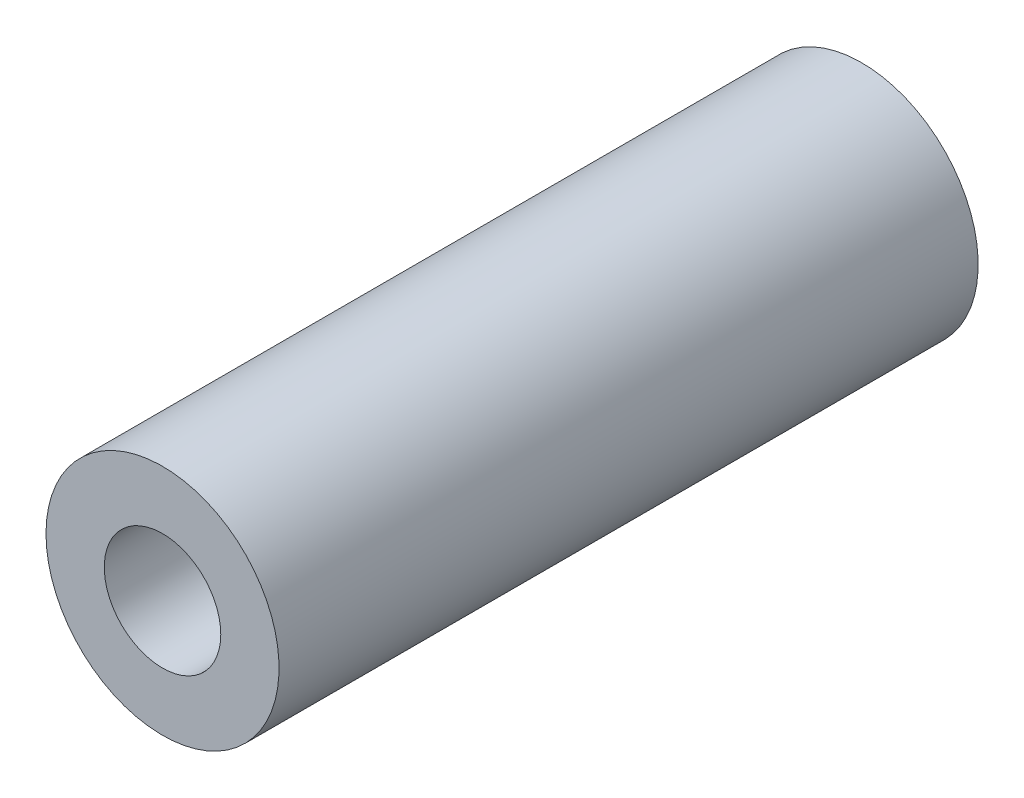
ISO-10303-21;
HEADER;
FILE_DESCRIPTION(('STEP AP214'),'2;1');
FILE_NAME('part.step','',(''),(''),'','','');
FILE_SCHEMA(('AUTOMOTIVE_DESIGN { 1 0 10303 214 1 1 1 1 }'));
ENDSEC;
DATA;
#1=APPLICATION_CONTEXT('core data for automotive mechanical design processes');
#2=APPLICATION_PROTOCOL_DEFINITION('international standard','automotive_design',2000,#1);
#3=PRODUCT_CONTEXT('',#1,'mechanical');
#4=PRODUCT('Part','Part','',(#3));
#5=PRODUCT_RELATED_PRODUCT_CATEGORY('part','',(#4));
#6=PRODUCT_DEFINITION_FORMATION('','',#4);
#7=PRODUCT_DEFINITION_CONTEXT('part definition',#1,'design');
#8=PRODUCT_DEFINITION('design','',#6,#7);
#9=PRODUCT_DEFINITION_SHAPE('','',#8);
#10=(LENGTH_UNIT() NAMED_UNIT(*) SI_UNIT(.MILLI.,.METRE.));
#11=(NAMED_UNIT(*) PLANE_ANGLE_UNIT() SI_UNIT($,.RADIAN.));
#12=(NAMED_UNIT(*) SI_UNIT($,.STERADIAN.) SOLID_ANGLE_UNIT());
#13=UNCERTAINTY_MEASURE_WITH_UNIT(LENGTH_MEASURE(1.E-05),#10,'distance_accuracy_value','');
#14=(GEOMETRIC_REPRESENTATION_CONTEXT(3) GLOBAL_UNCERTAINTY_ASSIGNED_CONTEXT((#13)) GLOBAL_UNIT_ASSIGNED_CONTEXT((#10,
#11,#12)) REPRESENTATION_CONTEXT('',''));
#15=CARTESIAN_POINT('',(0.,0.,0.));
#16=DIRECTION('',(0.,0.,1.));
#17=DIRECTION('',(1.,0.,0.));
#18=AXIS2_PLACEMENT_3D('',#15,#16,#17);
#19=CARTESIAN_POINT('',(0.,0.,19.05));
#20=DIRECTION('',(0.,0.,-1.));
#21=DIRECTION('',(-1.,0.,0.));
#22=AXIS2_PLACEMENT_3D('',#19,#20,#21);
#23=CYLINDRICAL_SURFACE('',#22,3.175);
#24=CARTESIAN_POINT('',(0.,0.,19.05));
#25=DIRECTION('',(0.,0.,1.));
#26=DIRECTION('',(1.,0.,0.));
#27=AXIS2_PLACEMENT_3D('',#24,#25,#26);
#28=CIRCLE('',#27,3.175);
#29=CARTESIAN_POINT('',(-3.175,0.,19.05));
#30=VERTEX_POINT('',#29);
#31=EDGE_CURVE('E10',#30,#30,#28,.T.);
#32=CARTESIAN_POINT('',(0.,0.,0.));
#33=DIRECTION('',(0.,0.,1.));
#34=DIRECTION('',(1.,0.,0.));
#35=AXIS2_PLACEMENT_3D('',#32,#33,#34);
#36=CIRCLE('',#35,3.175);
#37=CARTESIAN_POINT('',(-3.175,0.,0.));
#38=VERTEX_POINT('',#37);
#39=EDGE_CURVE('E38',#38,#38,#36,.T.);
#40=CARTESIAN_POINT('',(-3.175,0.,19.05));
#41=CARTESIAN_POINT('',(-3.175,0.,18.8515625));
#42=CARTESIAN_POINT('',(-3.175,0.,18.653125));
#43=CARTESIAN_POINT('',(-3.175,0.,18.25625));
#44=CARTESIAN_POINT('',(-3.175,0.,18.0578125));
#45=CARTESIAN_POINT('',(-3.175,0.,17.6609375));
#46=CARTESIAN_POINT('',(-3.175,0.,17.4625));
#47=CARTESIAN_POINT('',(-3.175,0.,17.065625));
#48=CARTESIAN_POINT('',(-3.175,0.,16.8671875));
#49=CARTESIAN_POINT('',(-3.175,0.,16.4703125));
#50=CARTESIAN_POINT('',(-3.175,0.,16.271875));
#51=CARTESIAN_POINT('',(-3.175,0.,15.875));
#52=CARTESIAN_POINT('',(-3.175,0.,15.6765625));
#53=CARTESIAN_POINT('',(-3.175,0.,15.2796875));
#54=CARTESIAN_POINT('',(-3.175,0.,15.08125));
#55=CARTESIAN_POINT('',(-3.175,0.,14.684375));
#56=CARTESIAN_POINT('',(-3.175,0.,14.4859375));
#57=CARTESIAN_POINT('',(-3.175,0.,14.0890625));
#58=CARTESIAN_POINT('',(-3.175,0.,13.890625));
#59=CARTESIAN_POINT('',(-3.175,0.,13.49375));
#60=CARTESIAN_POINT('',(-3.175,0.,13.2953125));
#61=CARTESIAN_POINT('',(-3.175,0.,12.8984375));
#62=CARTESIAN_POINT('',(-3.175,0.,12.7));
#63=CARTESIAN_POINT('',(-3.175,0.,12.303125));
#64=CARTESIAN_POINT('',(-3.175,0.,12.1046875));
#65=CARTESIAN_POINT('',(-3.175,0.,11.7078125));
#66=CARTESIAN_POINT('',(-3.175,0.,11.509375));
#67=CARTESIAN_POINT('',(-3.175,0.,11.1125));
#68=CARTESIAN_POINT('',(-3.175,0.,10.9140625));
#69=CARTESIAN_POINT('',(-3.175,0.,10.5171875));
#70=CARTESIAN_POINT('',(-3.175,0.,10.31875));
#71=CARTESIAN_POINT('',(-3.175,0.,9.921875));
#72=CARTESIAN_POINT('',(-3.175,0.,9.7234375));
#73=CARTESIAN_POINT('',(-3.175,0.,9.3265625));
#74=CARTESIAN_POINT('',(-3.175,0.,9.128125));
#75=CARTESIAN_POINT('',(-3.175,0.,8.73125));
#76=CARTESIAN_POINT('',(-3.175,0.,8.5328125));
#77=CARTESIAN_POINT('',(-3.175,0.,8.1359375));
#78=CARTESIAN_POINT('',(-3.175,0.,7.9375));
#79=CARTESIAN_POINT('',(-3.175,0.,7.540625));
#80=CARTESIAN_POINT('',(-3.175,0.,7.3421875));
#81=CARTESIAN_POINT('',(-3.175,0.,6.9453125));
#82=CARTESIAN_POINT('',(-3.175,0.,6.746875));
#83=CARTESIAN_POINT('',(-3.175,0.,6.35));
#84=CARTESIAN_POINT('',(-3.175,0.,6.1515625));
#85=CARTESIAN_POINT('',(-3.175,0.,5.7546875));
#86=CARTESIAN_POINT('',(-3.175,0.,5.55625));
#87=CARTESIAN_POINT('',(-3.175,0.,5.159375));
#88=CARTESIAN_POINT('',(-3.175,0.,4.9609375));
#89=CARTESIAN_POINT('',(-3.175,0.,4.5640625));
#90=CARTESIAN_POINT('',(-3.175,0.,4.365625));
#91=CARTESIAN_POINT('',(-3.175,0.,3.96875));
#92=CARTESIAN_POINT('',(-3.175,0.,3.7703125));
#93=CARTESIAN_POINT('',(-3.175,0.,3.3734375));
#94=CARTESIAN_POINT('',(-3.175,0.,3.175));
#95=CARTESIAN_POINT('',(-3.175,0.,2.778125));
#96=CARTESIAN_POINT('',(-3.175,0.,2.5796875));
#97=CARTESIAN_POINT('',(-3.175,0.,2.1828125));
#98=CARTESIAN_POINT('',(-3.175,0.,1.984375));
#99=CARTESIAN_POINT('',(-3.175,0.,1.5875));
#100=CARTESIAN_POINT('',(-3.175,0.,1.3890625));
#101=CARTESIAN_POINT('',(-3.175,0.,0.992187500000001));
#102=CARTESIAN_POINT('',(-3.175,0.,0.793750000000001));
#103=CARTESIAN_POINT('',(-3.175,0.,0.396875));
#104=CARTESIAN_POINT('',(-3.175,0.,0.1984375));
#105=CARTESIAN_POINT('',(-3.175,0.,0.));
#106=B_SPLINE_CURVE_WITH_KNOTS('',3,(#40,#41,#42,#43,#44,#45,#46,#47,#48,#49,#50,#51,#52,#53,
#54,#55,#56,#57,#58,#59,#60,#61,#62,#63,#64,#65,#66,#67,#68,#69,#70,#71,#72,#73,#74,#75,#76,#77,
#78,#79,#80,#81,#82,#83,#84,#85,#86,#87,#88,#89,#90,#91,#92,#93,#94,#95,#96,#97,#98,#99,#100,
#101,#102,#103,#104,#105),.UNSPECIFIED.,.F.,.F.,(4,2,2,2,2,2,2,2,2,2,2,2,2,2,2,2,2,2,2,2,2,2,2,
2,2,2,2,2,2,2,2,2,4),(0.,0.595312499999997,1.190625,1.7859375,2.38125,2.9765625,3.571875,
4.1671875,4.7625,5.3578125,5.953125,6.5484375,7.14375,7.7390625,8.334375,8.9296875,9.525,
10.1203125,10.715625,11.3109375,11.90625,12.5015625,13.096875,13.6921875,14.2875,14.8828125,
15.478125,16.0734375,16.66875,17.2640625,17.859375,18.4546875,19.05),.UNSPECIFIED.);
#107=EDGE_CURVE('BSEAM31',#30,#38,#106,.T.);
#108=ORIENTED_EDGE('',*,*,#31,.F.);
#109=ORIENTED_EDGE('',*,*,#39,.T.);
#110=ORIENTED_EDGE('',*,*,#107,.T.);
#111=ORIENTED_EDGE('',*,*,#107,.F.);
#112=EDGE_LOOP('',(#108,#110,#109,#111));
#113=FACE_BOUND('',#112,.T.);
#114=ADVANCED_FACE('F31',(#113),#23,.T.);
#115=CARTESIAN_POINT('',(0.,0.,19.05));
#116=DIRECTION('',(0.,0.,1.));
#117=DIRECTION('',(1.,0.,0.));
#118=AXIS2_PLACEMENT_3D('',#115,#116,#117);
#119=PLANE('',#118);
#120=CARTESIAN_POINT('',(0.,0.,19.05));
#121=DIRECTION('',(0.,0.,1.));
#122=DIRECTION('',(1.,0.,0.));
#123=AXIS2_PLACEMENT_3D('',#120,#121,#122);
#124=CIRCLE('',#123,1.5875);
#125=CARTESIAN_POINT('',(1.5875,0.,19.05));
#126=VERTEX_POINT('',#125);
#127=EDGE_CURVE('E44',#126,#126,#124,.T.);
#128=ORIENTED_EDGE('',*,*,#127,.F.);
#129=EDGE_LOOP('',(#128));
#130=FACE_BOUND('',#129,.T.);
#131=ORIENTED_EDGE('',*,*,#31,.T.);
#132=EDGE_LOOP('',(#131));
#133=FACE_BOUND('',#132,.T.);
#134=ADVANCED_FACE('F60',(#130,#133),#119,.T.);
#135=CARTESIAN_POINT('',(0.,0.,0.));
#136=DIRECTION('',(0.,0.,1.));
#137=DIRECTION('',(1.,0.,0.));
#138=AXIS2_PLACEMENT_3D('',#135,#136,#137);
#139=PLANE('',#138);
#140=CARTESIAN_POINT('',(0.,0.,0.));
#141=DIRECTION('',(0.,0.,1.));
#142=DIRECTION('',(1.,0.,0.));
#143=AXIS2_PLACEMENT_3D('',#140,#141,#142);
#144=CIRCLE('',#143,1.5875);
#145=CARTESIAN_POINT('',(1.5875,0.,0.));
#146=VERTEX_POINT('',#145);
#147=EDGE_CURVE('E34',#146,#146,#144,.T.);
#148=ORIENTED_EDGE('',*,*,#147,.T.);
#149=EDGE_LOOP('',(#148));
#150=FACE_BOUND('',#149,.T.);
#151=ORIENTED_EDGE('',*,*,#39,.F.);
#152=EDGE_LOOP('',(#151));
#153=FACE_BOUND('',#152,.T.);
#154=ADVANCED_FACE('F51',(#150,#153),#139,.F.);
#155=CARTESIAN_POINT('',(0.,0.,-19.05));
#156=DIRECTION('',(0.,0.,1.));
#157=DIRECTION('',(1.,0.,0.));
#158=AXIS2_PLACEMENT_3D('',#155,#156,#157);
#159=CYLINDRICAL_SURFACE('',#158,1.5875);
#160=CARTESIAN_POINT('',(1.5875,0.,19.05));
#161=CARTESIAN_POINT('',(1.5875,0.,18.8515625));
#162=CARTESIAN_POINT('',(1.5875,0.,18.653125));
#163=CARTESIAN_POINT('',(1.5875,0.,18.25625));
#164=CARTESIAN_POINT('',(1.5875,0.,18.0578125));
#165=CARTESIAN_POINT('',(1.5875,0.,17.6609375));
#166=CARTESIAN_POINT('',(1.5875,0.,17.4625));
#167=CARTESIAN_POINT('',(1.5875,0.,17.065625));
#168=CARTESIAN_POINT('',(1.5875,0.,16.8671875));
#169=CARTESIAN_POINT('',(1.5875,0.,16.4703125));
#170=CARTESIAN_POINT('',(1.5875,0.,16.271875));
#171=CARTESIAN_POINT('',(1.5875,0.,15.875));
#172=CARTESIAN_POINT('',(1.5875,0.,15.6765625));
#173=CARTESIAN_POINT('',(1.5875,0.,15.2796875));
#174=CARTESIAN_POINT('',(1.5875,0.,15.08125));
#175=CARTESIAN_POINT('',(1.5875,0.,14.684375));
#176=CARTESIAN_POINT('',(1.5875,0.,14.4859375));
#177=CARTESIAN_POINT('',(1.5875,0.,14.0890625));
#178=CARTESIAN_POINT('',(1.5875,0.,13.890625));
#179=CARTESIAN_POINT('',(1.5875,0.,13.49375));
#180=CARTESIAN_POINT('',(1.5875,0.,13.2953125));
#181=CARTESIAN_POINT('',(1.5875,0.,12.8984375));
#182=CARTESIAN_POINT('',(1.5875,0.,12.7));
#183=CARTESIAN_POINT('',(1.5875,0.,12.303125));
#184=CARTESIAN_POINT('',(1.5875,0.,12.1046875));
#185=CARTESIAN_POINT('',(1.5875,0.,11.7078125));
#186=CARTESIAN_POINT('',(1.5875,0.,11.509375));
#187=CARTESIAN_POINT('',(1.5875,0.,11.1125));
#188=CARTESIAN_POINT('',(1.5875,0.,10.9140625));
#189=CARTESIAN_POINT('',(1.5875,0.,10.5171875));
#190=CARTESIAN_POINT('',(1.5875,0.,10.31875));
#191=CARTESIAN_POINT('',(1.5875,0.,9.921875));
#192=CARTESIAN_POINT('',(1.5875,0.,9.7234375));
#193=CARTESIAN_POINT('',(1.5875,0.,9.3265625));
#194=CARTESIAN_POINT('',(1.5875,0.,9.128125));
#195=CARTESIAN_POINT('',(1.5875,0.,8.73125));
#196=CARTESIAN_POINT('',(1.5875,0.,8.5328125));
#197=CARTESIAN_POINT('',(1.5875,0.,8.1359375));
#198=CARTESIAN_POINT('',(1.5875,0.,7.9375));
#199=CARTESIAN_POINT('',(1.5875,0.,7.540625));
#200=CARTESIAN_POINT('',(1.5875,0.,7.3421875));
#201=CARTESIAN_POINT('',(1.5875,0.,6.9453125));
#202=CARTESIAN_POINT('',(1.5875,0.,6.746875));
#203=CARTESIAN_POINT('',(1.5875,0.,6.35));
#204=CARTESIAN_POINT('',(1.5875,0.,6.1515625));
#205=CARTESIAN_POINT('',(1.5875,0.,5.7546875));
#206=CARTESIAN_POINT('',(1.5875,0.,5.55625));
#207=CARTESIAN_POINT('',(1.5875,0.,5.159375));
#208=CARTESIAN_POINT('',(1.5875,0.,4.9609375));
#209=CARTESIAN_POINT('',(1.5875,0.,4.5640625));
#210=CARTESIAN_POINT('',(1.5875,0.,4.365625));
#211=CARTESIAN_POINT('',(1.5875,0.,3.96875));
#212=CARTESIAN_POINT('',(1.5875,0.,3.7703125));
#213=CARTESIAN_POINT('',(1.5875,0.,3.3734375));
#214=CARTESIAN_POINT('',(1.5875,0.,3.175));
#215=CARTESIAN_POINT('',(1.5875,0.,2.778125));
#216=CARTESIAN_POINT('',(1.5875,0.,2.5796875));
#217=CARTESIAN_POINT('',(1.5875,0.,2.1828125));
#218=CARTESIAN_POINT('',(1.5875,0.,1.984375));
#219=CARTESIAN_POINT('',(1.5875,0.,1.5875));
#220=CARTESIAN_POINT('',(1.5875,0.,1.3890625));
#221=CARTESIAN_POINT('',(1.5875,0.,0.992187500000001));
#222=CARTESIAN_POINT('',(1.5875,0.,0.793750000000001));
#223=CARTESIAN_POINT('',(1.5875,0.,0.396875));
#224=CARTESIAN_POINT('',(1.5875,0.,0.1984375));
#225=CARTESIAN_POINT('',(1.5875,0.,0.));
#226=B_SPLINE_CURVE_WITH_KNOTS('',3,(#160,#161,#162,#163,#164,#165,#166,#167,#168,#169,#170,
#171,#172,#173,#174,#175,#176,#177,#178,#179,#180,#181,#182,#183,#184,#185,#186,#187,#188,#189,
#190,#191,#192,#193,#194,#195,#196,#197,#198,#199,#200,#201,#202,#203,#204,#205,#206,#207,#208,
#209,#210,#211,#212,#213,#214,#215,#216,#217,#218,#219,#220,#221,#222,#223,#224,#225),
.UNSPECIFIED.,.F.,.F.,(4,2,2,2,2,2,2,2,2,2,2,2,2,2,2,2,2,2,2,2,2,2,2,2,2,2,2,2,2,2,2,2,4),(0.,
0.5953125,1.190625,1.7859375,2.38125,2.9765625,3.571875,4.1671875,4.7625,5.3578125,5.953125,
6.5484375,7.14375,7.7390625,8.334375,8.9296875,9.525,10.1203125,10.715625,11.3109375,11.90625,
12.5015625,13.096875,13.6921875,14.2875,14.8828125,15.478125,16.0734375,16.66875,17.2640625,
17.859375,18.4546875,19.05),.UNSPECIFIED.);
#227=EDGE_CURVE('BSEAM54',#126,#146,#226,.T.);
#228=ORIENTED_EDGE('',*,*,#127,.T.);
#229=ORIENTED_EDGE('',*,*,#147,.F.);
#230=ORIENTED_EDGE('',*,*,#227,.T.);
#231=ORIENTED_EDGE('',*,*,#227,.F.);
#232=EDGE_LOOP('',(#228,#230,#229,#231));
#233=FACE_BOUND('',#232,.T.);
#234=ADVANCED_FACE('F54',(#233),#159,.F.);
#235=CLOSED_SHELL('',(#114,#134,#154,#234));
#236=MANIFOLD_SOLID_BREP('B2',#235);
#237=ADVANCED_BREP_SHAPE_REPRESENTATION('',(#18,#236),#14);
#238=SHAPE_DEFINITION_REPRESENTATION(#9,#237);
ENDSEC;
END-ISO-10303-21;
